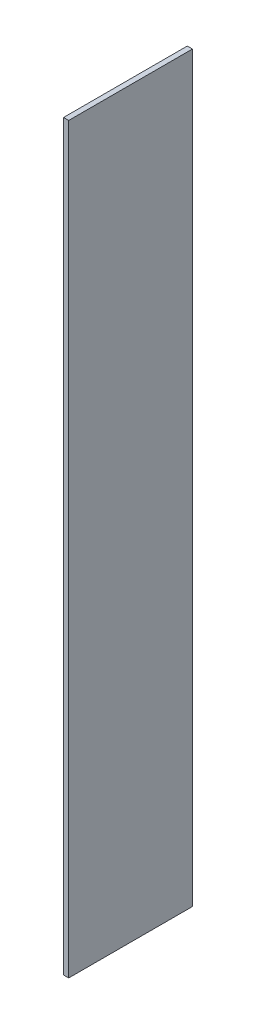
from build123d import *

# Parameters (mm, degrees)
SKETCH1_W           = 6.35
SKETCH1_H           = 914.4
BOSS_EXTRUDE1_DEPTH = 152.4


with BuildPart() as part:
    # Sketch1 → Boss-Extrude1 (new body)
    with BuildSketch(Plane.XY):
        with Locations((3.175, 457.2)):
            Rectangle(SKETCH1_W, SKETCH1_H)
    extrude(amount=BOSS_EXTRUDE1_DEPTH)


solid = part.part
